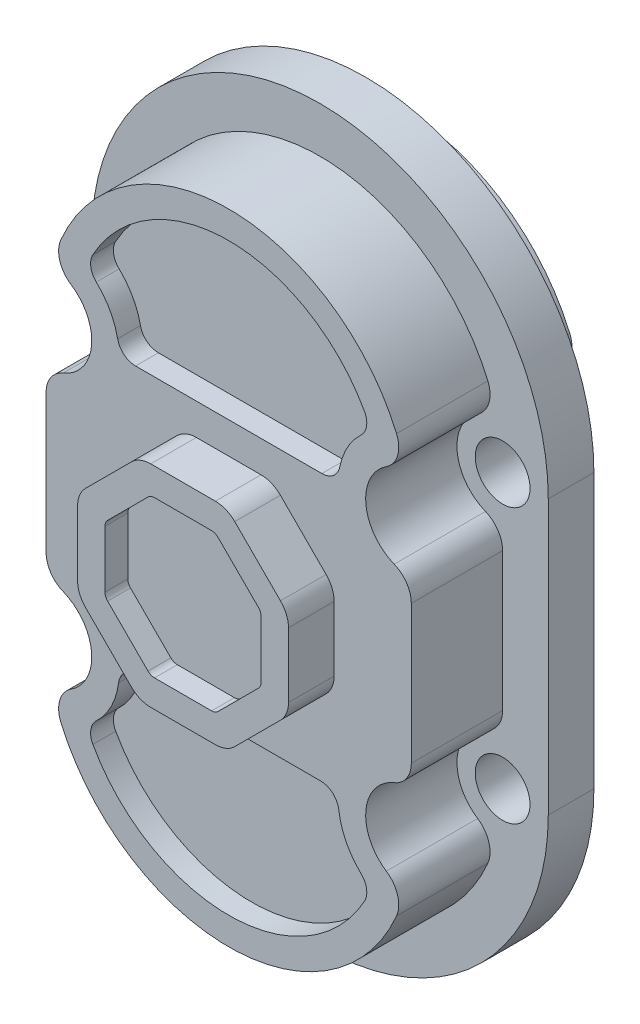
from build123d import *

# Parameters (mm, degrees)
BOSS_EXTRUDE1_DEPTH      = 5
BOSS_EXTRUDE1_DEPTH_BACK = 5
BOSS_EXTRUDE2_DEPTH      = 20
BOSS_EXTRUDE4_DEPTH      = 8
BOSS_EXTRUDE5_DEPTH      = 10
CUT_EXTRUDE1_DEPTH       = 5
CUT_EXTRUDE2_DEPTH       = 5
M10_CLEARANCE_HOLE1_D    = 12


with BuildPart() as part:
    # Sketch1 → Boss-Extrude1 (new, two sides: drawn at the far end of the back side and taken through both)
    with BuildSketch(Plane.XY.offset(-BOSS_EXTRUDE1_DEPTH_BACK)):
        with BuildLine():
            Line((-50, -30), (-50, 30))
            ThreePointArc((-50, 30), (0, 80), (50, 30))
            Line((50, 30), (50, -30))
            ThreePointArc((50, -30), (0, -80), (-50, -30))
        make_face()
    extrude(amount=BOSS_EXTRUDE1_DEPTH + BOSS_EXTRUDE1_DEPTH_BACK)

    # Sketch2 → Boss-Extrude2 (add)
    with BuildSketch(Plane.XY.offset(5)):
        with BuildLine():
            Line((40, -15.167603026), (40, 15.167603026))
            ThreePointArc((40, 15.167603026), (38.974937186, 18.521704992), (36.25, 20.729751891))
            ThreePointArc((36.25, 20.729751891), (30.047119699, 29.030374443), (34.53125, 38.372142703))
            ThreePointArc((34.53125, 38.372142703), (36.993242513, 41.65900515), (36.764705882, 45.759327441))
            ThreePointArc((36.764705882, 45.759327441), (0, 70), (-36.764705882, 45.759327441))
            ThreePointArc((-36.764705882, 45.759327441), (-36.993242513, 41.65900515), (-34.53125, 38.372142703))
            ThreePointArc((-34.53125, 38.372142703), (-30.047119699, 29.030374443), (-36.25, 20.729751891))
            ThreePointArc((-36.25, 20.729751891), (-38.974937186, 18.521704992), (-40, 15.167603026))
            Line((-40, 15.167603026), (-40, -15.167603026))
            ThreePointArc((-40, -15.167603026), (-38.974937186, -18.521704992), (-36.25, -20.729751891))
            ThreePointArc((-36.25, -20.729751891), (-30.047119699, -29.030374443), (-34.53125, -38.372142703))
            ThreePointArc((-34.53125, -38.372142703), (-36.993242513, -41.65900515), (-36.764705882, -45.759327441))
            ThreePointArc((-36.764705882, -45.759327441), (0, -70), (36.764705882, -45.759327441))
            ThreePointArc((36.764705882, -45.759327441), (36.993242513, -41.65900515), (34.53125, -38.372142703))
            ThreePointArc((34.53125, -38.372142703), (30.047119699, -29.030374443), (36.25, -20.729751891))
            ThreePointArc((36.25, -20.729751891), (38.974937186, -18.521704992), (40, -15.167603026))
        make_face()
    extrude(amount=BOSS_EXTRUDE2_DEPTH)

    # Sketch3 → Boss-Extrude4 (add)
    with BuildSketch(Plane(origin=(0, 0, -5), x_dir=(-1, 0, 0), z_dir=(0, 0, -1))):
        with BuildLine():
            Line((39.95, -15.167603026), (39.95, 15.167603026))
            ThreePointArc((39.95, 15.167603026), (38.933479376, 18.493754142), (36.23125, 20.683400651))
            ThreePointArc((36.23125, 20.683400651), (29.997355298, 29.025526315), (34.50390625, 38.414003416))
            ThreePointArc((34.50390625, 38.414003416), (36.945382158, 41.673475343), (36.71875, 45.739628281))
            ThreePointArc((36.71875, 45.739628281), (0, 69.95), (-36.71875, 45.739628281))
            ThreePointArc((-36.71875, 45.739628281), (-36.945382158, 41.673475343), (-34.50390625, 38.414003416))
            ThreePointArc((-34.50390625, 38.414003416), (-29.997355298, 29.025526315), (-36.23125, 20.683400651))
            ThreePointArc((-36.23125, 20.683400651), (-38.933479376, 18.493754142), (-39.95, 15.167603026))
            Line((-39.95, 15.167603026), (-39.95, -15.167603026))
            ThreePointArc((-39.95, -15.167603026), (-38.933479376, -18.493754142), (-36.23125, -20.683400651))
            ThreePointArc((-36.23125, -20.683400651), (-29.997355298, -29.025526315), (-34.50390625, -38.414003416))
            ThreePointArc((-34.50390625, -38.414003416), (-36.945382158, -41.673475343), (-36.71875, -45.739628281))
            ThreePointArc((-36.71875, -45.739628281), (0, -69.95), (36.71875, -45.739628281))
            ThreePointArc((36.71875, -45.739628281), (36.945382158, -41.673475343), (34.50390625, -38.414003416))
            ThreePointArc((34.50390625, -38.414003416), (29.997355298, -29.025526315), (36.23125, -20.683400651))
            ThreePointArc((36.23125, -20.683400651), (38.933479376, -18.493754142), (39.95, -15.167603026))
        make_face()
    extrude(amount=BOSS_EXTRUDE4_DEPTH)

    # Sketch4 → Boss-Extrude5 (add)
    with BuildSketch(Plane.XY.offset(25)):
        with BuildLine():
            Line((7.081804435, 23.096988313), (-7.081804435, 23.096988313))
            ThreePointArc((-7.081804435, 23.096988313), (-9.377905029, 22.640265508), (-11.324445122, 21.339629))
            Line((-11.324445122, 21.339629), (-21.339629, 11.324445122))
            ThreePointArc((-21.339629, 11.324445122), (-22.640265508, 9.377905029), (-23.096988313, 7.081804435))
            Line((-23.096988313, 7.081804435), (-23.096988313, -7.081804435))
            ThreePointArc((-23.096988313, -7.081804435), (-22.640265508, -9.377905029), (-21.339629, -11.324445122))
            Line((-21.339629, -11.324445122), (-11.324445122, -21.339629))
            ThreePointArc((-11.324445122, -21.339629), (-9.377905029, -22.640265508), (-7.081804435, -23.096988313))
            Line((-7.081804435, -23.096988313), (7.081804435, -23.096988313))
            ThreePointArc((7.081804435, -23.096988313), (9.377905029, -22.640265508), (11.324445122, -21.339629))
            Line((11.324445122, -21.339629), (21.339629, -11.324445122))
            ThreePointArc((21.339629, -11.324445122), (22.640265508, -9.377905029), (23.096988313, -7.081804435))
            Line((23.096988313, -7.081804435), (23.096988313, 7.081804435))
            ThreePointArc((23.096988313, 7.081804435), (22.640265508, 9.377905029), (21.339629, 11.324445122))
            Line((21.339629, 11.324445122), (11.324445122, 21.339629))
            ThreePointArc((11.324445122, 21.339629), (9.377905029, 22.640265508), (7.081804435, 23.096988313))
        make_face()
    extrude(amount=BOSS_EXTRUDE5_DEPTH)

    # Sketch6 → Cut-Extrude1 (cut)
    with BuildSketch(Plane.XY.offset(35)):
        with BuildLine():
            Line((-16.511201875, -7.667590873), (-7.667590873, -16.511201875))
            ThreePointArc((-7.667590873, -16.511201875), (-7.018744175, -16.944747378), (-6.25337731, -17.096988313))
            Line((-6.25337731, -17.096988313), (6.25337731, -17.096988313))
            ThreePointArc((6.25337731, -17.096988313), (7.018744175, -16.944747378), (7.667590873, -16.511201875))
            Line((7.667590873, -16.511201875), (16.511201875, -7.667590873))
            ThreePointArc((16.511201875, -7.667590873), (16.944747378, -7.018744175), (17.096988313, -6.25337731))
            Line((17.096988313, -6.25337731), (17.096988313, 6.25337731))
            ThreePointArc((17.096988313, 6.25337731), (16.944747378, 7.018744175), (16.511201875, 7.667590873))
            Line((16.511201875, 7.667590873), (7.667590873, 16.511201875))
            ThreePointArc((7.667590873, 16.511201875), (7.018744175, 16.944747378), (6.25337731, 17.096988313))
            Line((6.25337731, 17.096988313), (-6.25337731, 17.096988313))
            ThreePointArc((-6.25337731, 17.096988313), (-7.018744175, 16.944747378), (-7.667590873, 16.511201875))
            Line((-7.667590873, 16.511201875), (-16.511201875, 7.667590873))
            ThreePointArc((-16.511201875, 7.667590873), (-16.944747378, 7.018744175), (-17.096988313, 6.25337731))
            Line((-17.096988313, 6.25337731), (-17.096988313, -6.25337731))
            ThreePointArc((-17.096988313, -6.25337731), (-16.944747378, -7.018744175), (-16.511201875, -7.667590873))
        make_face()
    extrude(amount=-CUT_EXTRUDE1_DEPTH, mode=Mode.SUBTRACT)

    # Sketch10 → Cut-Extrude2 (cut)
    with BuildSketch(Plane.XY.offset(25)):
        with BuildLine():
            Line((-20.404082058, 30), (20.404082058, 30))
            ThreePointArc((20.404082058, 30), (22.933904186, 30.901613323), (24.323265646, 33.2))
            ThreePointArc((24.323265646, 33.2), (26.013159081, 37.769702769), (29, 41.618950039))
            ThreePointArc((29, 41.618950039), (30.202847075, 43.911315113), (29.75, 46.460179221))
            ThreePointArc((29.75, 46.460179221), (0, 64), (-29.75, 46.460179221))
            ThreePointArc((-29.75, 46.460179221), (-30.202847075, 43.911315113), (-29, 41.618950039))
            ThreePointArc((-29, 41.618950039), (-26.013159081, 37.769702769), (-24.323265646, 33.2))
            ThreePointArc((-24.323265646, 33.2), (-22.933904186, 30.901613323), (-20.404082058, 30))
        make_face()
        with BuildLine():
            Line((-20.150456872, -28.448599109), (20.150456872, -28.448599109))
            ThreePointArc((20.150456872, -28.448599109), (22.800090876, -29.452027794), (24.120365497, -31.958879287))
            ThreePointArc((24.120365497, -31.958879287), (25.718615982, -37.214019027), (29, -41.618950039))
            ThreePointArc((29, -41.618950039), (30.202847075, -43.911315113), (29.75, -46.460179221))
            ThreePointArc((29.75, -46.460179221), (0, -64), (-29.75, -46.460179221))
            ThreePointArc((-29.75, -46.460179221), (-30.202847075, -43.911315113), (-29, -41.618950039))
            ThreePointArc((-29, -41.618950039), (-25.718615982, -37.214019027), (-24.120365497, -31.958879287))
            ThreePointArc((-24.120365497, -31.958879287), (-22.800090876, -29.452027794), (-20.150456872, -28.448599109))
        make_face()
    extrude(amount=-CUT_EXTRUDE2_DEPTH, mode=Mode.SUBTRACT)

    # M10 Clearance Hole1 (through all)
    with Locations(Plane.XY.offset(5)):
        with Locations((-40, 30), (-40, -30), (40, -30), (40, 30)):
            Hole(M10_CLEARANCE_HOLE1_D / 2)


solid = part.part
